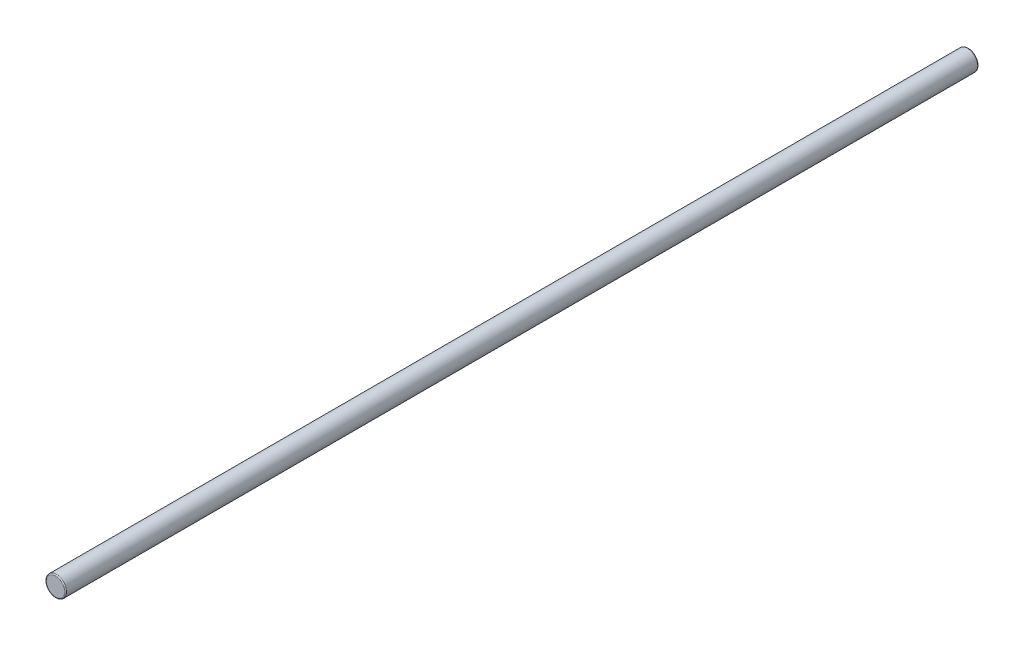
from build123d import *

# Parameters (mm, degrees)
ESQUISSE1_R      = 10
EXTRUSION1_DEPTH = 900
CONG_1_R         = 1
CONG_2_R         = 1


with BuildPart() as part:
    # Esquisse1 → Extrusion1 (new body)
    with BuildSketch(Plane.XY):
        Circle(ESQUISSE1_R)
    extrude(amount=EXTRUSION1_DEPTH)

    # Cong_1
    cong_1_edges = [part.edges().sort_by_distance(p)[0] for p in [
        (-10, 0, 900),
    ]]
    fillet(cong_1_edges, radius=CONG_1_R)

    # Cong_2
    cong_2_edges = [part.edges().sort_by_distance(p)[0] for p in [
        (-10, 0, 0),
    ]]
    fillet(cong_2_edges, radius=CONG_2_R)


solid = part.part
